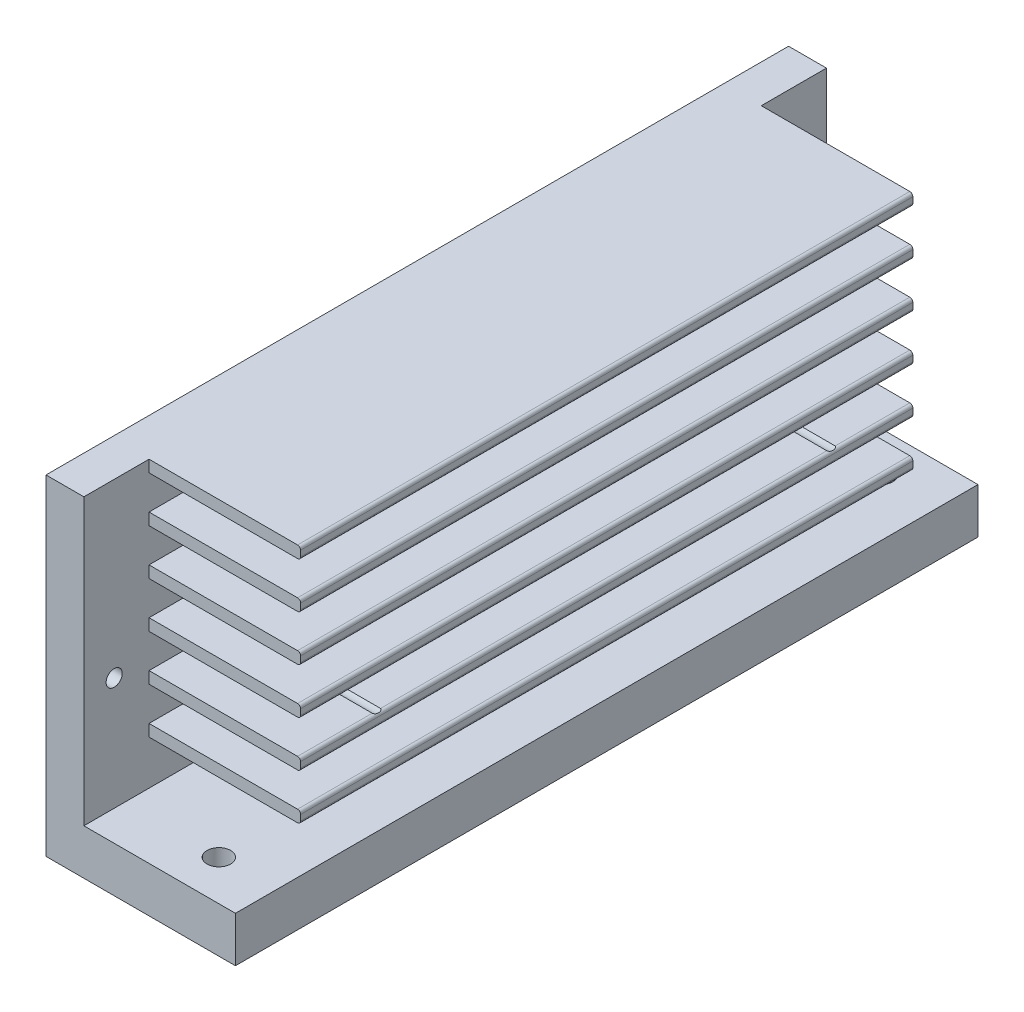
from build123d import *

# Parameters (mm, degrees)
EXTRUDE1_DEPTH                                 = 62.23
EXTRUDE2_DEPTH                                 = 124.46
LPATTERN1_COUNT                                = 6
LPATTERN1_PITCH                                = 7.6708
CUT_EXTRUDE1_REACH                             = 91.144
SKETCH5_R                                      = 1.981199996
SKETCH5_R_2                                    = 1.981200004
F_6_32_TAPPED_HOLE1_D                          = 2.7051
SKETCH6_W                                      = 10.922
SKETCH6_H                                      = 47.752
CUT_EXTRUDE3_DEPTH                             = 88.08496589
CSK_FOR_6_FLAT_HEAD_MACHINE_SCREW1_D           = 3.9624
CSK_FOR_6_FLAT_HEAD_MACHINE_SCREW1_CSINK_D     = 8.8529922
CSK_FOR_6_FLAT_HEAD_MACHINE_SCREW1_CSINK_ANGLE = 82


with BuildPart() as part:
    # Sketch1 → Extrude1 (new, symmetric)
    with BuildSketch(Plane.XY):
        Polygon((0, 0), (0, 55.372), (6.35, 55.372), (6.35, 7.62), (31.75, 7.62), (31.75, 0), align=None)
    extrude(amount=EXTRUDE1_DEPTH, both=True)

    # Sketch2 → Extrude2 (add)
    with BuildSketch(Plane.XY.offset(62.23)):
        with BuildLine():
            Line((6.35, 55.372), (31.242, 55.372))
            ThreePointArc((31.242, 55.372), (31.601210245, 55.223210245), (31.75, 54.864))
            Line((31.75, 54.864), (31.75, 53.8988))
            ThreePointArc((31.75, 53.8988), (31.601210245, 53.539589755), (31.242, 53.3908))
            Line((31.242, 53.3908), (6.35, 53.3908))
            Line((6.35, 53.3908), (6.35, 55.372))
        make_face()
    extrude2 = extrude(amount=-EXTRUDE2_DEPTH)

    # LPattern1: Extrude2 ×6
    with Locations(*[(0, -i * LPATTERN1_PITCH, 0) for i in range(1, LPATTERN1_COUNT)]):
        add(extrude2)

    # Sketch5 → Cut-Extrude1 (cut, up to next)
    with BuildSketch(Plane.XZ, mode=Mode.PRIVATE) as cut_extrude1_sk1:
        with Locations(Location((22.225, 55.484790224, 0), (0, 0, 270))):
            Circle(SKETCH5_R)
    cut_extrude1_tool1 = extrude(cut_extrude1_sk1.sketch, amount=-CUT_EXTRUDE1_REACH, mode=Mode.PRIVATE) & part.part
    # Sketch5 → Cut-Extrude1 (cut, up to next)
    with BuildSketch(Plane.XZ, mode=Mode.PRIVATE) as cut_extrude1_sk2:
        with Locations(Location((22.225, -55.484790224, 0), (0, 0, 270))):
            Circle(SKETCH5_R_2)
    cut_extrude1_tool2 = extrude(cut_extrude1_sk2.sketch, amount=-CUT_EXTRUDE1_REACH, mode=Mode.PRIVATE) & part.part
    add(cut_extrude1_tool1.solids().sort_by_distance((22.225, 0, 55.48479))[0], mode=Mode.SUBTRACT)
    add(cut_extrude1_tool2.solids().sort_by_distance((22.225, 0, -55.48479))[0], mode=Mode.SUBTRACT)

    # 6-32 Tapped Hole1 (through all)
    with Locations(Plane.ZY):
        with Locations((-57.15, 26.543), (57.15, 26.543)):
            Hole(F_6_32_TAPPED_HOLE1_D / 2)

    # Sketch6 → Cut-Extrude3 (cut, through all)
    with BuildSketch(Plane(origin=(6.35, 0, 0), x_dir=(0, 0, -1), z_dir=(1, 0, 0))):
        with Locations((56.769, 31.496)):
            Rectangle(SKETCH6_W, SKETCH6_H)
        with Locations((-56.769, 31.496)):
            Rectangle(SKETCH6_W, SKETCH6_H)
    extrude(amount=CUT_EXTRUDE3_DEPTH, mode=Mode.SUBTRACT)

    # CSK for _6 Flat Head Machine Screw1 (through all)
    with Locations(Plane(origin=(0, 26.543, -38.1), x_dir=(0, 0, -1), z_dir=(-1, 0, 0))):
        with Locations((0, 0), (-76.2, 0)):
            CounterSinkHole(CSK_FOR_6_FLAT_HEAD_MACHINE_SCREW1_D / 2, CSK_FOR_6_FLAT_HEAD_MACHINE_SCREW1_CSINK_D / 2, counter_sink_angle=CSK_FOR_6_FLAT_HEAD_MACHINE_SCREW1_CSINK_ANGLE)


solid = part.part
